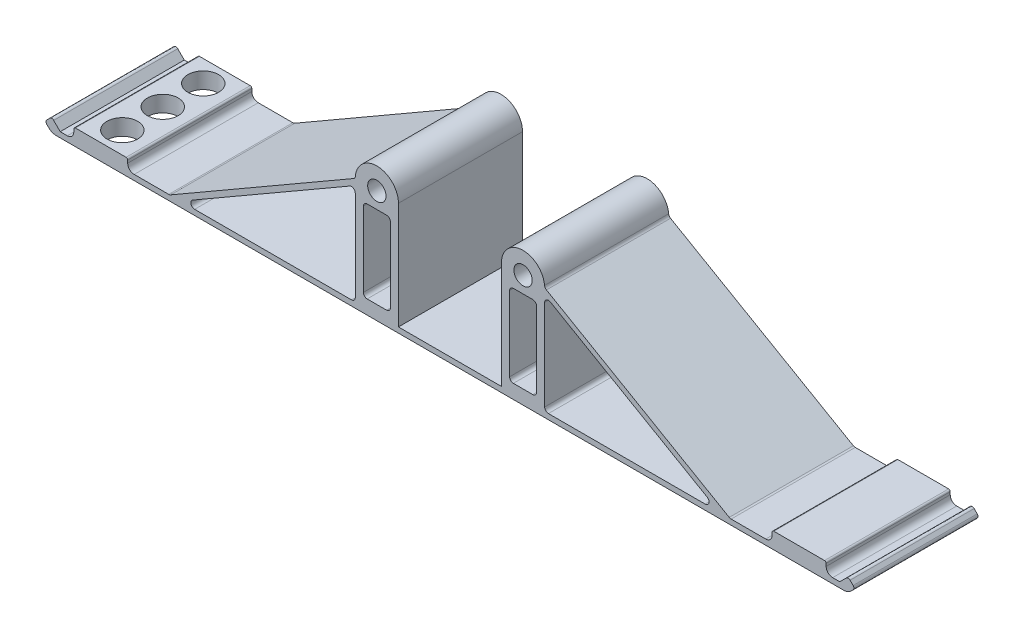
from build123d import *

# Parameters (mm, degrees)
SKETCH_1_W             = 5
SKETCH_1_H             = 15.25
SKETCH_1_R             = 1.7
EXTRUDE_1_DEPTH        = 23
FILLET_1_R             = 0.7
SKETCH_2_R             = 2.85
CUT_EXTRUDE_1_DEPTH    = 10
SKETCH_3_W             = 10
SKETCH_3_H             = 23
SKETCH_3_R             = 2.85
EXTRUDE_2_DEPTH        = 2
FILLET_2_R             = 0.3
FILLET_3_R             = 1.2
FILLET_2_OF_MIRROR_1_R = 0.3
FILLET_3_OF_MIRROR_1_R = 1.2
SKETCH_4_R             = 2.85
EXTRUDE_3_DEPTH        = 3


with BuildPart() as part:
    # Sketch 1 → Extrude 1 (new body)
    with BuildSketch(Plane.XY):
        with BuildLine():
            Line((9.55, -74.15), (9.55, -94))
            Line((9.55, -94), (-9.55, -94))
            Line((-9.55, -94), (-9.55, -74.15))
            ThreePointArc((-9.55, -74.15), (-13.55, -70.15), (-17.55, -74.15))
            Line((-17.55, -74.15), (-51.93120853, -94))
            Line((-51.93120853, -94), (-72.241212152, -94))
            Line((-72.241212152, -94), (-73.453344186, -92.787867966))
            ThreePointArc((-73.453344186, -92.787867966), (-73.806897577, -92.641421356), (-74.160450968, -92.787867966))
            Line((-74.160450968, -92.787867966), (-74.726136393, -93.353553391))
            ThreePointArc((-74.726136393, -93.353553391), (-74.872583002, -93.707106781), (-74.726136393, -94.060660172))
            Line((-74.726136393, -94.060660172), (-74.372583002, -94.414213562))
            ThreePointArc((-74.372583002, -94.414213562), (-73.723736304, -94.847759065), (-72.95836944, -95))
            Line((-72.95836944, -95), (72.95836944, -95))
            ThreePointArc((72.95836944, -95), (73.723736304, -94.847759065), (74.372583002, -94.414213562))
            Line((74.372583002, -94.414213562), (74.726136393, -94.060660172))
            ThreePointArc((74.726136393, -94.060660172), (74.872583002, -93.707106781), (74.726136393, -93.353553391))
            Line((74.726136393, -93.353553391), (74.160450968, -92.787867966))
            ThreePointArc((74.160450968, -92.787867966), (73.806897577, -92.641421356), (73.453344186, -92.787867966))
            Line((73.453344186, -92.787867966), (72.241212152, -94))
            Line((72.241212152, -94), (51.93120853, -94))
            Line((51.93120853, -94), (17.55, -74.15))
            ThreePointArc((17.55, -74.15), (13.55, -70.15), (9.55, -74.15))
        make_face()
        Polygon((17.55, -94), (17.55, -75.304700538), (49.93120853, -94), align=None, mode=Mode.SUBTRACT)
        with Locations((13.55, -84.775)):
            Rectangle(SKETCH_1_W, SKETCH_1_H, mode=Mode.SUBTRACT)
        Polygon((-17.55, -75.304700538), (-17.55, -94), (-49.93120853, -94), align=None, mode=Mode.SUBTRACT)
        with Locations((-13.55, -84.775)):
            Rectangle(SKETCH_1_W, SKETCH_1_H, mode=Mode.SUBTRACT)
        with Locations((13.55, -74.15)):
            Circle(SKETCH_1_R, mode=Mode.SUBTRACT)
        with Locations((-13.55, -74.15)):
            Circle(SKETCH_1_R, mode=Mode.SUBTRACT)
    extrude(amount=EXTRUDE_1_DEPTH)

    # Fillet 1
    fillet_1_edges = [part.edges().sort_by_distance(p)[0] for p in [
        (-51.93120853, -94, 11.5),
        (-17.55, -74.15, 11.5),
        (17.55, -74.15, 11.5),
        (51.93120853, -94, 11.5),
        (-49.93120853, -94, 11.5),
        (-17.55, -94, 11.5),
        (-17.55, -75.304700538, 11.5),
        (-16.05, -77.15, 11.5),
        (-16.05, -92.4, 11.5),
        (-11.05, -92.4, 11.5),
        (-11.05, -77.15, 11.5),
        (17.55, -94, 11.5),
        (49.93120853, -94, 11.5),
        (17.55, -75.304700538, 11.5),
        (11.05, -92.4, 11.5),
        (16.05, -92.4, 11.5),
        (16.05, -77.15, 11.5),
        (11.05, -77.15, 11.5),
    ]]
    fillet(fillet_1_edges, radius=FILLET_1_R)

    # Sketch 2 → Cut-Extrude 1 (cut)
    with BuildSketch(Plane.XZ.offset(95)):
        with Locations(Location((-64.726136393, 11.5, 0), (0, 0, 270))):
            Circle(SKETCH_2_R)
        with Locations(Location((-64.726136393, 19, 0), (0, 0, 270))):
            Circle(SKETCH_2_R)
        with Locations(Location((-64.726136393, 4, 0), (0, 0, 90))):
            Circle(SKETCH_2_R)
    cut_extrude_1 = extrude(amount=-CUT_EXTRUDE_1_DEPTH, mode=Mode.SUBTRACT)

    # Sketch 3 → Extrude 2 (add)
    with BuildSketch(Plane(origin=(0, -94, 0), x_dir=(1, 0, 0), z_dir=(0, 1, 0))):
        with Locations((-64.726136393, -11.5)):
            Rectangle(SKETCH_3_W, SKETCH_3_H)
        with Locations(Location((-64.726136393, -4, 0), (0, 0, 270))):
            Circle(SKETCH_3_R, mode=Mode.SUBTRACT)
        with Locations(Location((-64.726136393, -11.5, 0), (0, 0, 90))):
            Circle(SKETCH_3_R, mode=Mode.SUBTRACT)
        with Locations(Location((-64.726136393, -19, 0), (0, 0, 90))):
            Circle(SKETCH_3_R, mode=Mode.SUBTRACT)
    extrude_2 = extrude(amount=EXTRUDE_2_DEPTH)

    # Fillet 2
    fillet_2_edges = [part.edges().sort_by_distance(p)[0] for p in [
        (-69.726136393, -92, 11.5),
        (-59.726136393, -92, 11.5),
    ]]
    fillet(fillet_2_edges, radius=FILLET_2_R)

    # Fillet 3
    fillet_3_edges = [part.edges().sort_by_distance(p)[0] for p in [
        (-69.726136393, -94, 11.5),
        (-59.726136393, -94, 11.5),
    ]]
    fillet(fillet_3_edges, radius=FILLET_3_R)

    # Mirror 1: Cut-Extrude 1, Extrude 2 across plane
    add(cut_extrude_1.mirror(Plane(origin=(0, 0, 0), x_dir=(0, 0, 1), z_dir=(1, 0, 0))), mode=Mode.SUBTRACT)
    add(extrude_2.mirror(Plane(origin=(0, 0, 0), x_dir=(0, 0, 1), z_dir=(1, 0, 0))))

    # Fillet 2 of Mirror 1
    fillet_2_of_mirror_1_edges = [part.edges().sort_by_distance(p)[0] for p in [
        (69.726136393, -92, 11.5),
        (59.726136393, -92, 11.5),
    ]]
    fillet(fillet_2_of_mirror_1_edges, radius=FILLET_2_OF_MIRROR_1_R)

    # Fillet 3 of Mirror 1
    fillet_3_of_mirror_1_edges = [part.edges().sort_by_distance(p)[0] for p in [
        (69.726136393, -94, 11.5),
        (59.726136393, -94, 11.5),
    ]]
    fillet(fillet_3_of_mirror_1_edges, radius=FILLET_3_OF_MIRROR_1_R)

    # Sketch 4 → Extrude 3 (add)
    with BuildSketch(Plane.XZ.offset(95)):
        with Locations((64.726136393, 4)):
            Circle(SKETCH_4_R)
        with Locations((64.726136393, 11.5)):
            Circle(SKETCH_4_R)
        with Locations((64.726136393, 19)):
            Circle(SKETCH_4_R)
    extrude(amount=-EXTRUDE_3_DEPTH)


solid = part.part
